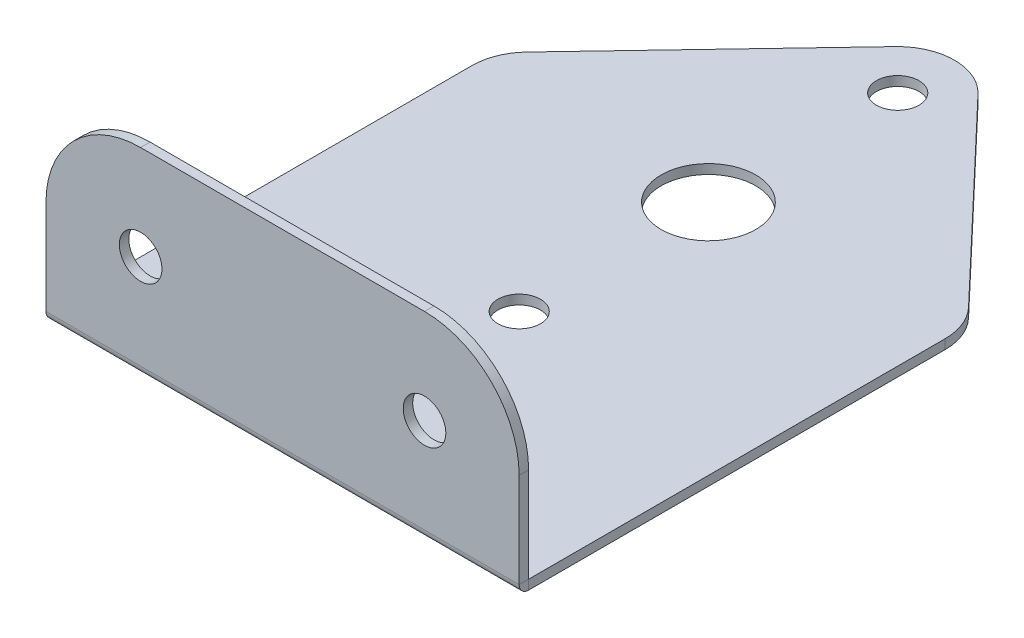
ISO-10303-21;
HEADER;
FILE_DESCRIPTION(('STEP AP214'),'2;1');
FILE_NAME('part.step','',(''),(''),'','','');
FILE_SCHEMA(('AUTOMOTIVE_DESIGN { 1 0 10303 214 1 1 1 1 }'));
ENDSEC;
DATA;
#1=APPLICATION_CONTEXT('core data for automotive mechanical design processes');
#2=APPLICATION_PROTOCOL_DEFINITION('international standard','automotive_design',2000,#1);
#3=PRODUCT_CONTEXT('',#1,'mechanical');
#4=PRODUCT('Part','Part','',(#3));
#5=PRODUCT_RELATED_PRODUCT_CATEGORY('part','',(#4));
#6=PRODUCT_DEFINITION_FORMATION('','',#4);
#7=PRODUCT_DEFINITION_CONTEXT('part definition',#1,'design');
#8=PRODUCT_DEFINITION('design','',#6,#7);
#9=PRODUCT_DEFINITION_SHAPE('','',#8);
#10=(LENGTH_UNIT() NAMED_UNIT(*) SI_UNIT(.MILLI.,.METRE.));
#11=(NAMED_UNIT(*) PLANE_ANGLE_UNIT() SI_UNIT($,.RADIAN.));
#12=(NAMED_UNIT(*) SI_UNIT($,.STERADIAN.) SOLID_ANGLE_UNIT());
#13=UNCERTAINTY_MEASURE_WITH_UNIT(LENGTH_MEASURE(1.E-05),#10,'distance_accuracy_value','');
#14=(GEOMETRIC_REPRESENTATION_CONTEXT(3) GLOBAL_UNCERTAINTY_ASSIGNED_CONTEXT((#13)) GLOBAL_UNIT_ASSIGNED_CONTEXT((#10,
#11,#12)) REPRESENTATION_CONTEXT('',''));
#15=CARTESIAN_POINT('',(0.,0.,0.));
#16=DIRECTION('',(0.,0.,1.));
#17=DIRECTION('',(1.,0.,0.));
#18=AXIS2_PLACEMENT_3D('',#15,#16,#17);
#19=CARTESIAN_POINT('',(6.,-44.995,-21.9949999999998));
#20=DIRECTION('',(0.,0.,-1.));
#21=DIRECTION('',(0.,1.,0.));
#22=AXIS2_PLACEMENT_3D('',#19,#20,#21);
#23=PLANE('',#22);
#24=CARTESIAN_POINT('',(10.,11.005,-21.995));
#25=DIRECTION('',(0.,0.,-1.));
#26=DIRECTION('',(0.,1.,0.));
#27=AXIS2_PLACEMENT_3D('',#24,#25,#26);
#28=CIRCLE('',#27,2.25);
#29=CARTESIAN_POINT('',(10.,13.255,-21.995));
#30=VERTEX_POINT('',#29);
#31=EDGE_CURVE('E240',#30,#30,#28,.T.);
#32=ORIENTED_EDGE('',*,*,#31,.F.);
#33=EDGE_LOOP('',(#32));
#34=FACE_BOUND('',#33,.T.);
#35=CARTESIAN_POINT('',(40.,11.005,-21.995));
#36=DIRECTION('',(0.,0.,-1.));
#37=DIRECTION('',(0.,1.,0.));
#38=AXIS2_PLACEMENT_3D('',#35,#36,#37);
#39=CIRCLE('',#38,2.25);
#40=CARTESIAN_POINT('',(40.,13.255,-21.995));
#41=VERTEX_POINT('',#40);
#42=EDGE_CURVE('E234',#41,#41,#39,.T.);
#43=ORIENTED_EDGE('',*,*,#42,.F.);
#44=EDGE_LOOP('',(#43));
#45=FACE_BOUND('',#44,.T.);
#46=DIRECTION('',(0.,1.,0.));
#47=VECTOR('',#46,1.);
#48=CARTESIAN_POINT('',(0.,21.005,-21.9950000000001));
#49=LINE('',#48,#47);
#50=CARTESIAN_POINT('',(0.,1.,-21.995));
#51=VERTEX_POINT('',#50);
#52=CARTESIAN_POINT('',(0.,11.005,-21.995));
#53=VERTEX_POINT('',#52);
#54=EDGE_CURVE('E250',#51,#53,#49,.T.);
#55=ORIENTED_EDGE('',*,*,#54,.T.);
#56=CARTESIAN_POINT('',(10.,11.005,-21.995));
#57=DIRECTION('',(0.,0.,-1.));
#58=DIRECTION('',(0.,1.,0.));
#59=AXIS2_PLACEMENT_3D('',#56,#57,#58);
#60=CIRCLE('',#59,10.);
#61=CARTESIAN_POINT('',(10.,21.005,-21.9950000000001));
#62=VERTEX_POINT('',#61);
#63=EDGE_CURVE('E12',#53,#62,#60,.T.);
#64=ORIENTED_EDGE('',*,*,#63,.T.);
#65=DIRECTION('',(1.,0.,0.));
#66=VECTOR('',#65,1.);
#67=CARTESIAN_POINT('',(0.,21.005,-21.9950000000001));
#68=LINE('',#67,#66);
#69=CARTESIAN_POINT('',(40.,21.005,-21.9950000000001));
#70=VERTEX_POINT('',#69);
#71=EDGE_CURVE('E247',#62,#70,#68,.T.);
#72=ORIENTED_EDGE('',*,*,#71,.T.);
#73=CARTESIAN_POINT('',(40.,11.005,-21.995));
#74=DIRECTION('',(0.,0.,-1.));
#75=DIRECTION('',(0.,1.,0.));
#76=AXIS2_PLACEMENT_3D('',#73,#74,#75);
#77=CIRCLE('',#76,10.);
#78=CARTESIAN_POINT('',(50.,11.005,-21.995));
#79=VERTEX_POINT('',#78);
#80=EDGE_CURVE('E269',#70,#79,#77,.T.);
#81=ORIENTED_EDGE('',*,*,#80,.T.);
#82=DIRECTION('',(0.,-1.,0.));
#83=VECTOR('',#82,1.);
#84=CARTESIAN_POINT('',(50.,21.005,-21.9950000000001));
#85=LINE('',#84,#83);
#86=CARTESIAN_POINT('',(50.,1.,-21.995));
#87=VERTEX_POINT('',#86);
#88=EDGE_CURVE('E249',#79,#87,#85,.T.);
#89=ORIENTED_EDGE('',*,*,#88,.T.);
#90=DIRECTION('',(-1.,0.,0.));
#91=VECTOR('',#90,1.);
#92=CARTESIAN_POINT('',(6.,1.,-21.995));
#93=LINE('',#92,#91);
#94=EDGE_CURVE('E140',#87,#51,#93,.T.);
#95=ORIENTED_EDGE('',*,*,#94,.T.);
#96=EDGE_LOOP('',(#55,#64,#72,#81,#89,#95));
#97=FACE_BOUND('',#96,.T.);
#98=ADVANCED_FACE('F36',(#34,#45,#97),#23,.T.);
#99=CARTESIAN_POINT('',(6.,-44.995,-20.9949999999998));
#100=DIRECTION('',(0.,0.,-1.));
#101=DIRECTION('',(0.,1.,0.));
#102=AXIS2_PLACEMENT_3D('',#99,#100,#101);
#103=PLANE('',#102);
#104=DIRECTION('',(1.,0.,0.));
#105=VECTOR('',#104,1.);
#106=CARTESIAN_POINT('',(0.,21.005,-20.9950000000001));
#107=LINE('',#106,#105);
#108=CARTESIAN_POINT('',(10.,21.005,-20.9950000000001));
#109=VERTEX_POINT('',#108);
#110=CARTESIAN_POINT('',(40.,21.005,-20.9950000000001));
#111=VERTEX_POINT('',#110);
#112=EDGE_CURVE('E244',#109,#111,#107,.T.);
#113=ORIENTED_EDGE('',*,*,#112,.F.);
#114=CARTESIAN_POINT('',(10.,11.005,-20.995));
#115=DIRECTION('',(0.,0.,-1.));
#116=DIRECTION('',(0.,1.,0.));
#117=AXIS2_PLACEMENT_3D('',#114,#115,#116);
#118=CIRCLE('',#117,10.);
#119=CARTESIAN_POINT('',(0.,11.005,-20.995));
#120=VERTEX_POINT('',#119);
#121=EDGE_CURVE('E58',#109,#120,#118,.F.);
#122=ORIENTED_EDGE('',*,*,#121,.T.);
#123=DIRECTION('',(0.,1.,0.));
#124=VECTOR('',#123,1.);
#125=CARTESIAN_POINT('',(0.,21.005,-20.9950000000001));
#126=LINE('',#125,#124);
#127=CARTESIAN_POINT('',(0.,1.,-20.995));
#128=VERTEX_POINT('',#127);
#129=EDGE_CURVE('E243',#128,#120,#126,.T.);
#130=ORIENTED_EDGE('',*,*,#129,.F.);
#131=DIRECTION('',(-1.,0.,0.));
#132=VECTOR('',#131,1.);
#133=CARTESIAN_POINT('',(6.,1.00000000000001,-20.995));
#134=LINE('',#133,#132);
#135=CARTESIAN_POINT('',(50.,1.,-20.995));
#136=VERTEX_POINT('',#135);
#137=EDGE_CURVE('E137',#136,#128,#134,.T.);
#138=ORIENTED_EDGE('',*,*,#137,.F.);
#139=DIRECTION('',(0.,-1.,0.));
#140=VECTOR('',#139,1.);
#141=CARTESIAN_POINT('',(50.,21.005,-20.9950000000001));
#142=LINE('',#141,#140);
#143=CARTESIAN_POINT('',(50.,11.005,-20.995));
#144=VERTEX_POINT('',#143);
#145=EDGE_CURVE('E246',#144,#136,#142,.T.);
#146=ORIENTED_EDGE('',*,*,#145,.F.);
#147=CARTESIAN_POINT('',(40.,11.005,-20.995));
#148=DIRECTION('',(0.,0.,-1.));
#149=DIRECTION('',(0.,1.,0.));
#150=AXIS2_PLACEMENT_3D('',#147,#148,#149);
#151=CIRCLE('',#150,10.);
#152=EDGE_CURVE('E263',#144,#111,#151,.F.);
#153=ORIENTED_EDGE('',*,*,#152,.T.);
#154=EDGE_LOOP('',(#113,#122,#130,#138,#146,#153));
#155=FACE_BOUND('',#154,.T.);
#156=CARTESIAN_POINT('',(10.,11.005,-20.995));
#157=DIRECTION('',(0.,0.,-1.));
#158=DIRECTION('',(0.,1.,0.));
#159=AXIS2_PLACEMENT_3D('',#156,#157,#158);
#160=CIRCLE('',#159,2.25);
#161=CARTESIAN_POINT('',(10.,13.255,-20.995));
#162=VERTEX_POINT('',#161);
#163=EDGE_CURVE('E237',#162,#162,#160,.T.);
#164=ORIENTED_EDGE('',*,*,#163,.T.);
#165=EDGE_LOOP('',(#164));
#166=FACE_BOUND('',#165,.T.);
#167=CARTESIAN_POINT('',(40.,11.005,-20.995));
#168=DIRECTION('',(0.,0.,-1.));
#169=DIRECTION('',(0.,1.,0.));
#170=AXIS2_PLACEMENT_3D('',#167,#168,#169);
#171=CIRCLE('',#170,2.25);
#172=CARTESIAN_POINT('',(40.,13.255,-20.995));
#173=VERTEX_POINT('',#172);
#174=EDGE_CURVE('E231',#173,#173,#171,.T.);
#175=ORIENTED_EDGE('',*,*,#174,.T.);
#176=EDGE_LOOP('',(#175));
#177=FACE_BOUND('',#176,.T.);
#178=ADVANCED_FACE('F280',(#155,#166,#177),#103,.F.);
#179=CARTESIAN_POINT('',(0.,21.005,-21.9950000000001));
#180=DIRECTION('',(1.,0.,0.));
#181=DIRECTION('',(0.,-1.,0.));
#182=AXIS2_PLACEMENT_3D('',#179,#180,#181);
#183=PLANE('',#182);
#184=ORIENTED_EDGE('',*,*,#129,.T.);
#185=DIRECTION('',(0.,0.,1.));
#186=VECTOR('',#185,1.);
#187=CARTESIAN_POINT('',(0.,11.005,-21.995));
#188=LINE('',#187,#186);
#189=EDGE_CURVE('E44',#120,#53,#188,.F.);
#190=ORIENTED_EDGE('',*,*,#189,.T.);
#191=ORIENTED_EDGE('',*,*,#54,.F.);
#192=DIRECTION('',(0.,0.,-1.));
#193=VECTOR('',#192,1.);
#194=CARTESIAN_POINT('',(0.,1.,-21.995));
#195=LINE('',#194,#193);
#196=EDGE_CURVE('E148',#128,#51,#195,.T.);
#197=ORIENTED_EDGE('',*,*,#196,.F.);
#198=EDGE_LOOP('',(#184,#190,#191,#197));
#199=FACE_BOUND('',#198,.T.);
#200=ADVANCED_FACE('F38',(#199),#183,.F.);
#201=CARTESIAN_POINT('',(0.,21.005,-21.9950000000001));
#202=DIRECTION('',(0.,-1.,0.));
#203=DIRECTION('',(-1.,0.,0.));
#204=AXIS2_PLACEMENT_3D('',#201,#202,#203);
#205=PLANE('',#204);
#206=ORIENTED_EDGE('',*,*,#71,.F.);
#207=DIRECTION('',(0.,0.,1.));
#208=VECTOR('',#207,1.);
#209=CARTESIAN_POINT('',(10.,21.005,-21.9950000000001));
#210=LINE('',#209,#208);
#211=EDGE_CURVE('E271',#62,#109,#210,.T.);
#212=ORIENTED_EDGE('',*,*,#211,.T.);
#213=ORIENTED_EDGE('',*,*,#112,.T.);
#214=DIRECTION('',(0.,0.,1.));
#215=VECTOR('',#214,1.);
#216=CARTESIAN_POINT('',(40.,21.005,-21.9950000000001));
#217=LINE('',#216,#215);
#218=EDGE_CURVE('E266',#111,#70,#217,.F.);
#219=ORIENTED_EDGE('',*,*,#218,.T.);
#220=EDGE_LOOP('',(#206,#212,#213,#219));
#221=FACE_BOUND('',#220,.T.);
#222=ADVANCED_FACE('F277',(#221),#205,.F.);
#223=CARTESIAN_POINT('',(50.,21.005,-21.9950000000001));
#224=DIRECTION('',(-1.,0.,0.));
#225=DIRECTION('',(0.,1.,0.));
#226=AXIS2_PLACEMENT_3D('',#223,#224,#225);
#227=PLANE('',#226);
#228=ORIENTED_EDGE('',*,*,#88,.F.);
#229=DIRECTION('',(0.,0.,1.));
#230=VECTOR('',#229,1.);
#231=CARTESIAN_POINT('',(50.,11.005,-21.995));
#232=LINE('',#231,#230);
#233=EDGE_CURVE('E256',#79,#144,#232,.T.);
#234=ORIENTED_EDGE('',*,*,#233,.T.);
#235=ORIENTED_EDGE('',*,*,#145,.T.);
#236=DIRECTION('',(0.,0.,1.));
#237=VECTOR('',#236,1.);
#238=CARTESIAN_POINT('',(50.,1.,-21.995));
#239=LINE('',#238,#237);
#240=EDGE_CURVE('E251',#87,#136,#239,.T.);
#241=ORIENTED_EDGE('',*,*,#240,.F.);
#242=EDGE_LOOP('',(#228,#234,#235,#241));
#243=FACE_BOUND('',#242,.T.);
#244=ADVANCED_FACE('F292',(#243),#227,.F.);
#245=CARTESIAN_POINT('',(10.,11.005,-21.995));
#246=DIRECTION('',(0.,0.,1.));
#247=DIRECTION('',(0.,-1.,0.));
#248=AXIS2_PLACEMENT_3D('',#245,#246,#247);
#249=CYLINDRICAL_SURFACE('',#248,2.25);
#250=ORIENTED_EDGE('',*,*,#31,.T.);
#251=EDGE_LOOP('',(#250));
#252=FACE_BOUND('',#251,.T.);
#253=ORIENTED_EDGE('',*,*,#163,.F.);
#254=EDGE_LOOP('',(#253));
#255=FACE_BOUND('',#254,.T.);
#256=ADVANCED_FACE('F351',(#252,#255),#249,.F.);
#257=CARTESIAN_POINT('',(40.,11.005,-21.995));
#258=DIRECTION('',(0.,0.,1.));
#259=DIRECTION('',(0.,-1.,0.));
#260=AXIS2_PLACEMENT_3D('',#257,#258,#259);
#261=CYLINDRICAL_SURFACE('',#260,2.25);
#262=ORIENTED_EDGE('',*,*,#42,.T.);
#263=EDGE_LOOP('',(#262));
#264=FACE_BOUND('',#263,.T.);
#265=ORIENTED_EDGE('',*,*,#174,.F.);
#266=EDGE_LOOP('',(#265));
#267=FACE_BOUND('',#266,.T.);
#268=ADVANCED_FACE('F356',(#264,#267),#261,.F.);
#269=CARTESIAN_POINT('',(25.,1.,-46.));
#270=DIRECTION('',(0.,-1.,0.));
#271=DIRECTION('',(0.,0.,-1.));
#272=AXIS2_PLACEMENT_3D('',#269,#270,#271);
#273=CYLINDRICAL_SURFACE('',#272,2.25);
#274=CARTESIAN_POINT('',(25.,1.,-46.));
#275=DIRECTION('',(0.,1.,0.));
#276=DIRECTION('',(0.,0.,1.));
#277=AXIS2_PLACEMENT_3D('',#274,#275,#276);
#278=CIRCLE('',#277,2.25);
#279=CARTESIAN_POINT('',(25.,1.,-43.75));
#280=VERTEX_POINT('',#279);
#281=EDGE_CURVE('E226',#280,#280,#278,.T.);
#282=ORIENTED_EDGE('',*,*,#281,.T.);
#283=EDGE_LOOP('',(#282));
#284=FACE_BOUND('',#283,.T.);
#285=CARTESIAN_POINT('',(25.,0.,-46.));
#286=DIRECTION('',(0.,1.,0.));
#287=DIRECTION('',(0.,0.,1.));
#288=AXIS2_PLACEMENT_3D('',#285,#286,#287);
#289=CIRCLE('',#288,2.25);
#290=CARTESIAN_POINT('',(25.,0.,-43.75));
#291=VERTEX_POINT('',#290);
#292=EDGE_CURVE('E175',#291,#291,#289,.T.);
#293=ORIENTED_EDGE('',*,*,#292,.F.);
#294=EDGE_LOOP('',(#293));
#295=FACE_BOUND('',#294,.T.);
#296=ADVANCED_FACE('F377',(#284,#295),#273,.F.);
#297=CARTESIAN_POINT('',(25.,1.,-86.));
#298=DIRECTION('',(0.,-1.,0.));
#299=DIRECTION('',(0.,0.,-1.));
#300=AXIS2_PLACEMENT_3D('',#297,#298,#299);
#301=CYLINDRICAL_SURFACE('',#300,2.25);
#302=CARTESIAN_POINT('',(25.,1.,-86.));
#303=DIRECTION('',(0.,1.,0.));
#304=DIRECTION('',(0.,0.,1.));
#305=AXIS2_PLACEMENT_3D('',#302,#303,#304);
#306=CIRCLE('',#305,2.25);
#307=CARTESIAN_POINT('',(25.,1.,-83.75));
#308=VERTEX_POINT('',#307);
#309=EDGE_CURVE('E223',#308,#308,#306,.T.);
#310=ORIENTED_EDGE('',*,*,#309,.T.);
#311=EDGE_LOOP('',(#310));
#312=FACE_BOUND('',#311,.T.);
#313=CARTESIAN_POINT('',(25.,0.,-86.));
#314=DIRECTION('',(0.,1.,0.));
#315=DIRECTION('',(0.,0.,1.));
#316=AXIS2_PLACEMENT_3D('',#313,#314,#315);
#317=CIRCLE('',#316,2.25);
#318=CARTESIAN_POINT('',(25.,0.,-83.75));
#319=VERTEX_POINT('',#318);
#320=EDGE_CURVE('E170',#319,#319,#317,.T.);
#321=ORIENTED_EDGE('',*,*,#320,.F.);
#322=EDGE_LOOP('',(#321));
#323=FACE_BOUND('',#322,.T.);
#324=ADVANCED_FACE('F336',(#312,#323),#301,.F.);
#325=CARTESIAN_POINT('',(25.,1.,-66.));
#326=DIRECTION('',(0.,-1.,0.));
#327=DIRECTION('',(0.,0.,-1.));
#328=AXIS2_PLACEMENT_3D('',#325,#326,#327);
#329=CYLINDRICAL_SURFACE('',#328,5.);
#330=CARTESIAN_POINT('',(25.,1.,-66.));
#331=DIRECTION('',(0.,1.,0.));
#332=DIRECTION('',(0.,0.,1.));
#333=AXIS2_PLACEMENT_3D('',#330,#331,#332);
#334=CIRCLE('',#333,5.);
#335=CARTESIAN_POINT('',(25.,1.,-61.));
#336=VERTEX_POINT('',#335);
#337=EDGE_CURVE('E220',#336,#336,#334,.T.);
#338=ORIENTED_EDGE('',*,*,#337,.T.);
#339=EDGE_LOOP('',(#338));
#340=FACE_BOUND('',#339,.T.);
#341=CARTESIAN_POINT('',(25.,0.,-66.));
#342=DIRECTION('',(0.,1.,0.));
#343=DIRECTION('',(0.,0.,1.));
#344=AXIS2_PLACEMENT_3D('',#341,#342,#343);
#345=CIRCLE('',#344,5.);
#346=CARTESIAN_POINT('',(25.,0.,-61.));
#347=VERTEX_POINT('',#346);
#348=EDGE_CURVE('E167',#347,#347,#345,.T.);
#349=ORIENTED_EDGE('',*,*,#348,.F.);
#350=EDGE_LOOP('',(#349));
#351=FACE_BOUND('',#350,.T.);
#352=ADVANCED_FACE('F329',(#340,#351),#329,.F.);
#353=CARTESIAN_POINT('',(6.,1.,-66.));
#354=DIRECTION('',(0.,-1.,0.));
#355=DIRECTION('',(0.,0.,-1.));
#356=AXIS2_PLACEMENT_3D('',#353,#354,#355);
#357=CYLINDRICAL_SURFACE('',#356,5.99999999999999);
#358=CARTESIAN_POINT('',(6.,0.,-66.));
#359=DIRECTION('',(0.,1.,0.));
#360=DIRECTION('',(0.,0.,1.));
#361=AXIS2_PLACEMENT_3D('',#358,#359,#360);
#362=CIRCLE('',#361,5.99999999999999);
#363=CARTESIAN_POINT('',(1.65000339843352,0.,-70.1324967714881));
#364=VERTEX_POINT('',#363);
#365=CARTESIAN_POINT('',(0.,0.,-66.));
#366=VERTEX_POINT('',#365);
#367=EDGE_CURVE('E218',#364,#366,#362,.T.);
#368=ORIENTED_EDGE('',*,*,#367,.T.);
#369=DIRECTION('',(0.,-1.,0.));
#370=VECTOR('',#369,1.);
#371=CARTESIAN_POINT('',(0.,1.,-66.));
#372=LINE('',#371,#370);
#373=CARTESIAN_POINT('',(0.,1.,-66.));
#374=VERTEX_POINT('',#373);
#375=EDGE_CURVE('E152',#374,#366,#372,.T.);
#376=ORIENTED_EDGE('',*,*,#375,.F.);
#377=CARTESIAN_POINT('',(6.,1.,-66.));
#378=DIRECTION('',(0.,1.,0.));
#379=DIRECTION('',(0.,0.,1.));
#380=AXIS2_PLACEMENT_3D('',#377,#378,#379);
#381=CIRCLE('',#380,5.99999999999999);
#382=CARTESIAN_POINT('',(1.65000339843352,1.,-70.1324967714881));
#383=VERTEX_POINT('',#382);
#384=EDGE_CURVE('E183',#383,#374,#381,.T.);
#385=ORIENTED_EDGE('',*,*,#384,.F.);
#386=DIRECTION('',(0.,-1.,0.));
#387=VECTOR('',#386,1.);
#388=CARTESIAN_POINT('',(1.65000339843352,1.,-70.1324967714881));
#389=LINE('',#388,#387);
#390=EDGE_CURVE('E215',#383,#364,#389,.T.);
#391=ORIENTED_EDGE('',*,*,#390,.T.);
#392=EDGE_LOOP('',(#368,#376,#385,#391));
#393=FACE_BOUND('',#392,.T.);
#394=ADVANCED_FACE('F325',(#393),#357,.T.);
#395=CARTESIAN_POINT('',(1.65000339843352,1.,-70.1324967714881));
#396=DIRECTION('',(0.724999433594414,0.,0.688749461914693));
#397=DIRECTION('',(0.688749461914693,0.,-0.724999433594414));
#398=AXIS2_PLACEMENT_3D('',#395,#396,#397);
#399=PLANE('',#398);
#400=DIRECTION('',(-0.688749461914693,0.,0.724999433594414));
#401=VECTOR('',#400,1.);
#402=CARTESIAN_POINT('',(1.65000339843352,0.,-70.1324967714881));
#403=LINE('',#402,#401);
#404=CARTESIAN_POINT('',(20.6500033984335,0.,-90.1324967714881));
#405=VERTEX_POINT('',#404);
#406=EDGE_CURVE('E213',#405,#364,#403,.T.);
#407=ORIENTED_EDGE('',*,*,#406,.T.);
#408=ORIENTED_EDGE('',*,*,#390,.F.);
#409=DIRECTION('',(-0.688749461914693,0.,0.724999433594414));
#410=VECTOR('',#409,1.);
#411=CARTESIAN_POINT('',(1.65000339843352,1.,-70.1324967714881));
#412=LINE('',#411,#410);
#413=CARTESIAN_POINT('',(20.6500033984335,1.,-90.1324967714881));
#414=VERTEX_POINT('',#413);
#415=EDGE_CURVE('E185',#414,#383,#412,.T.);
#416=ORIENTED_EDGE('',*,*,#415,.F.);
#417=DIRECTION('',(0.,-1.,0.));
#418=VECTOR('',#417,1.);
#419=CARTESIAN_POINT('',(20.6500033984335,1.,-90.1324967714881));
#420=LINE('',#419,#418);
#421=EDGE_CURVE('E210',#414,#405,#420,.T.);
#422=ORIENTED_EDGE('',*,*,#421,.T.);
#423=EDGE_LOOP('',(#407,#408,#416,#422));
#424=FACE_BOUND('',#423,.T.);
#425=ADVANCED_FACE('F322',(#424),#399,.F.);
#426=CARTESIAN_POINT('',(25.,1.,-86.));
#427=DIRECTION('',(0.,-1.,0.));
#428=DIRECTION('',(0.,0.,-1.));
#429=AXIS2_PLACEMENT_3D('',#426,#427,#428);
#430=CYLINDRICAL_SURFACE('',#429,5.99999999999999);
#431=CARTESIAN_POINT('',(25.,0.,-86.));
#432=DIRECTION('',(0.,1.,0.));
#433=DIRECTION('',(0.,0.,1.));
#434=AXIS2_PLACEMENT_3D('',#431,#432,#433);
#435=CIRCLE('',#434,5.99999999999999);
#436=CARTESIAN_POINT('',(29.3499966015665,0.,-90.1324967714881));
#437=VERTEX_POINT('',#436);
#438=EDGE_CURVE('E208',#437,#405,#435,.T.);
#439=ORIENTED_EDGE('',*,*,#438,.T.);
#440=ORIENTED_EDGE('',*,*,#421,.F.);
#441=CARTESIAN_POINT('',(25.,1.,-86.));
#442=DIRECTION('',(0.,1.,0.));
#443=DIRECTION('',(0.,0.,1.));
#444=AXIS2_PLACEMENT_3D('',#441,#442,#443);
#445=CIRCLE('',#444,5.99999999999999);
#446=CARTESIAN_POINT('',(29.3499966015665,1.,-90.1324967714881));
#447=VERTEX_POINT('',#446);
#448=EDGE_CURVE('E187',#447,#414,#445,.T.);
#449=ORIENTED_EDGE('',*,*,#448,.F.);
#450=DIRECTION('',(0.,-1.,0.));
#451=VECTOR('',#450,1.);
#452=CARTESIAN_POINT('',(29.3499966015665,1.,-90.1324967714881));
#453=LINE('',#452,#451);
#454=EDGE_CURVE('E205',#447,#437,#453,.T.);
#455=ORIENTED_EDGE('',*,*,#454,.T.);
#456=EDGE_LOOP('',(#439,#440,#449,#455));
#457=FACE_BOUND('',#456,.T.);
#458=ADVANCED_FACE('F317',(#457),#430,.T.);
#459=CARTESIAN_POINT('',(48.3499966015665,1.,-70.1324967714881));
#460=DIRECTION('',(-0.724999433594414,0.,0.688749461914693));
#461=DIRECTION('',(0.688749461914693,0.,0.724999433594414));
#462=AXIS2_PLACEMENT_3D('',#459,#460,#461);
#463=PLANE('',#462);
#464=DIRECTION('',(-0.688749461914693,0.,-0.724999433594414));
#465=VECTOR('',#464,1.);
#466=CARTESIAN_POINT('',(48.3499966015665,0.,-70.1324967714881));
#467=LINE('',#466,#465);
#468=CARTESIAN_POINT('',(48.3499966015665,0.,-70.1324967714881));
#469=VERTEX_POINT('',#468);
#470=EDGE_CURVE('E203',#469,#437,#467,.T.);
#471=ORIENTED_EDGE('',*,*,#470,.T.);
#472=ORIENTED_EDGE('',*,*,#454,.F.);
#473=DIRECTION('',(-0.688749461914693,0.,-0.724999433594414));
#474=VECTOR('',#473,1.);
#475=CARTESIAN_POINT('',(48.3499966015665,1.,-70.1324967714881));
#476=LINE('',#475,#474);
#477=CARTESIAN_POINT('',(48.3499966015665,1.,-70.1324967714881));
#478=VERTEX_POINT('',#477);
#479=EDGE_CURVE('E189',#478,#447,#476,.T.);
#480=ORIENTED_EDGE('',*,*,#479,.F.);
#481=DIRECTION('',(0.,-1.,0.));
#482=VECTOR('',#481,1.);
#483=CARTESIAN_POINT('',(48.3499966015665,1.,-70.1324967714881));
#484=LINE('',#483,#482);
#485=EDGE_CURVE('E200',#478,#469,#484,.T.);
#486=ORIENTED_EDGE('',*,*,#485,.T.);
#487=EDGE_LOOP('',(#471,#472,#480,#486));
#488=FACE_BOUND('',#487,.T.);
#489=ADVANCED_FACE('F313',(#488),#463,.F.);
#490=CARTESIAN_POINT('',(44.,1.,-66.));
#491=DIRECTION('',(0.,-1.,0.));
#492=DIRECTION('',(0.,0.,-1.));
#493=AXIS2_PLACEMENT_3D('',#490,#491,#492);
#494=CYLINDRICAL_SURFACE('',#493,5.99999999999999);
#495=CARTESIAN_POINT('',(44.,0.,-66.));
#496=DIRECTION('',(0.,1.,0.));
#497=DIRECTION('',(0.,0.,1.));
#498=AXIS2_PLACEMENT_3D('',#495,#496,#497);
#499=CIRCLE('',#498,5.99999999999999);
#500=CARTESIAN_POINT('',(50.,0.,-66.));
#501=VERTEX_POINT('',#500);
#502=EDGE_CURVE('E198',#501,#469,#499,.T.);
#503=ORIENTED_EDGE('',*,*,#502,.T.);
#504=ORIENTED_EDGE('',*,*,#485,.F.);
#505=CARTESIAN_POINT('',(44.,1.,-66.));
#506=DIRECTION('',(0.,1.,0.));
#507=DIRECTION('',(0.,0.,1.));
#508=AXIS2_PLACEMENT_3D('',#505,#506,#507);
#509=CIRCLE('',#508,5.99999999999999);
#510=CARTESIAN_POINT('',(50.,1.,-66.));
#511=VERTEX_POINT('',#510);
#512=EDGE_CURVE('E191',#511,#478,#509,.T.);
#513=ORIENTED_EDGE('',*,*,#512,.F.);
#514=DIRECTION('',(0.,-1.,0.));
#515=VECTOR('',#514,1.);
#516=CARTESIAN_POINT('',(50.,1.,-66.));
#517=LINE('',#516,#515);
#518=EDGE_CURVE('E195',#511,#501,#517,.T.);
#519=ORIENTED_EDGE('',*,*,#518,.T.);
#520=EDGE_LOOP('',(#503,#504,#513,#519));
#521=FACE_BOUND('',#520,.T.);
#522=ADVANCED_FACE('F307',(#521),#494,.T.);
#523=CARTESIAN_POINT('',(6.,1.,-66.));
#524=DIRECTION('',(0.,1.,0.));
#525=DIRECTION('',(0.,0.,1.));
#526=AXIS2_PLACEMENT_3D('',#523,#524,#525);
#527=PLANE('',#526);
#528=ORIENTED_EDGE('',*,*,#94,.F.);
#529=DIRECTION('',(0.,0.,-1.));
#530=VECTOR('',#529,1.);
#531=CARTESIAN_POINT('',(50.,1.,0.));
#532=LINE('',#531,#530);
#533=EDGE_CURVE('E193',#87,#511,#532,.T.);
#534=ORIENTED_EDGE('',*,*,#533,.T.);
#535=ORIENTED_EDGE('',*,*,#512,.T.);
#536=ORIENTED_EDGE('',*,*,#479,.T.);
#537=ORIENTED_EDGE('',*,*,#448,.T.);
#538=ORIENTED_EDGE('',*,*,#415,.T.);
#539=ORIENTED_EDGE('',*,*,#384,.T.);
#540=DIRECTION('',(0.,0.,1.));
#541=VECTOR('',#540,1.);
#542=CARTESIAN_POINT('',(0.,1.,0.));
#543=LINE('',#542,#541);
#544=EDGE_CURVE('E181',#374,#51,#543,.T.);
#545=ORIENTED_EDGE('',*,*,#544,.T.);
#546=EDGE_LOOP('',(#528,#534,#535,#536,#537,#538,#539,#545));
#547=FACE_BOUND('',#546,.T.);
#548=ORIENTED_EDGE('',*,*,#337,.F.);
#549=EDGE_LOOP('',(#548));
#550=FACE_BOUND('',#549,.T.);
#551=ORIENTED_EDGE('',*,*,#309,.F.);
#552=EDGE_LOOP('',(#551));
#553=FACE_BOUND('',#552,.T.);
#554=ORIENTED_EDGE('',*,*,#281,.F.);
#555=EDGE_LOOP('',(#554));
#556=FACE_BOUND('',#555,.T.);
#557=ADVANCED_FACE('F300',(#547,#550,#553,#556),#527,.T.);
#558=CARTESIAN_POINT('',(50.,1.,0.));
#559=DIRECTION('',(-1.,0.,0.));
#560=DIRECTION('',(0.,0.,1.));
#561=AXIS2_PLACEMENT_3D('',#558,#559,#560);
#562=PLANE('',#561);
#563=ORIENTED_EDGE('',*,*,#533,.F.);
#564=DIRECTION('',(0.,-1.,0.));
#565=VECTOR('',#564,1.);
#566=CARTESIAN_POINT('',(50.,0.999999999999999,-21.995));
#567=LINE('',#566,#565);
#568=CARTESIAN_POINT('',(50.,0.,-21.995));
#569=VERTEX_POINT('',#568);
#570=EDGE_CURVE('E179',#87,#569,#567,.T.);
#571=ORIENTED_EDGE('',*,*,#570,.T.);
#572=DIRECTION('',(0.,0.,-1.));
#573=VECTOR('',#572,1.);
#574=CARTESIAN_POINT('',(50.,0.,0.));
#575=LINE('',#574,#573);
#576=EDGE_CURVE('E165',#569,#501,#575,.T.);
#577=ORIENTED_EDGE('',*,*,#576,.T.);
#578=ORIENTED_EDGE('',*,*,#518,.F.);
#579=EDGE_LOOP('',(#563,#571,#577,#578));
#580=FACE_BOUND('',#579,.T.);
#581=ADVANCED_FACE('F303',(#580),#562,.F.);
#582=CARTESIAN_POINT('',(6.,0.,-66.));
#583=DIRECTION('',(0.,1.,0.));
#584=DIRECTION('',(0.,0.,1.));
#585=AXIS2_PLACEMENT_3D('',#582,#583,#584);
#586=PLANE('',#585);
#587=ORIENTED_EDGE('',*,*,#292,.T.);
#588=EDGE_LOOP('',(#587));
#589=FACE_BOUND('',#588,.T.);
#590=ORIENTED_EDGE('',*,*,#320,.T.);
#591=EDGE_LOOP('',(#590));
#592=FACE_BOUND('',#591,.T.);
#593=ORIENTED_EDGE('',*,*,#348,.T.);
#594=EDGE_LOOP('',(#593));
#595=FACE_BOUND('',#594,.T.);
#596=ORIENTED_EDGE('',*,*,#576,.F.);
#597=DIRECTION('',(-1.,0.,0.));
#598=VECTOR('',#597,1.);
#599=CARTESIAN_POINT('',(6.,0.,-21.995));
#600=LINE('',#599,#598);
#601=CARTESIAN_POINT('',(0.,0.,-21.995));
#602=VERTEX_POINT('',#601);
#603=EDGE_CURVE('E134',#569,#602,#600,.T.);
#604=ORIENTED_EDGE('',*,*,#603,.T.);
#605=DIRECTION('',(0.,0.,1.));
#606=VECTOR('',#605,1.);
#607=CARTESIAN_POINT('',(0.,0.,0.));
#608=LINE('',#607,#606);
#609=EDGE_CURVE('E153',#366,#602,#608,.T.);
#610=ORIENTED_EDGE('',*,*,#609,.F.);
#611=ORIENTED_EDGE('',*,*,#367,.F.);
#612=ORIENTED_EDGE('',*,*,#406,.F.);
#613=ORIENTED_EDGE('',*,*,#438,.F.);
#614=ORIENTED_EDGE('',*,*,#470,.F.);
#615=ORIENTED_EDGE('',*,*,#502,.F.);
#616=EDGE_LOOP('',(#596,#604,#610,#611,#612,#613,#614,#615));
#617=FACE_BOUND('',#616,.T.);
#618=ADVANCED_FACE('F163',(#589,#592,#595,#617),#586,.F.);
#619=CARTESIAN_POINT('',(0.,1.,0.));
#620=DIRECTION('',(1.,0.,0.));
#621=DIRECTION('',(0.,0.,-1.));
#622=AXIS2_PLACEMENT_3D('',#619,#620,#621);
#623=PLANE('',#622);
#624=ORIENTED_EDGE('',*,*,#609,.T.);
#625=DIRECTION('',(0.,1.,0.));
#626=VECTOR('',#625,1.);
#627=CARTESIAN_POINT('',(0.,0.999999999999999,-21.995));
#628=LINE('',#627,#626);
#629=EDGE_CURVE('E144',#602,#51,#628,.T.);
#630=ORIENTED_EDGE('',*,*,#629,.T.);
#631=ORIENTED_EDGE('',*,*,#544,.F.);
#632=ORIENTED_EDGE('',*,*,#375,.T.);
#633=EDGE_LOOP('',(#624,#630,#631,#632));
#634=FACE_BOUND('',#633,.T.);
#635=ADVANCED_FACE('F157',(#634),#623,.F.);
#636=CARTESIAN_POINT('',(0.,1.,-21.995));
#637=DIRECTION('',(-1.,0.,0.));
#638=DIRECTION('',(0.,0.,1.));
#639=AXIS2_PLACEMENT_3D('',#636,#637,#638);
#640=PLANE('',#639);
#641=CARTESIAN_POINT('',(0.,1.,-21.995));
#642=DIRECTION('',(1.,0.,0.));
#643=DIRECTION('',(0.,0.,-1.));
#644=AXIS2_PLACEMENT_3D('',#641,#642,#643);
#645=CIRCLE('',#644,1.);
#646=EDGE_CURVE('E129',#128,#602,#645,.T.);
#647=ORIENTED_EDGE('',*,*,#646,.F.);
#648=ORIENTED_EDGE('',*,*,#196,.T.);
#649=ORIENTED_EDGE('',*,*,#629,.F.);
#650=EDGE_LOOP('',(#647,#648,#649));
#651=FACE_BOUND('',#650,.T.);
#652=ADVANCED_FACE('F146',(#651),#640,.T.);
#653=CARTESIAN_POINT('',(50.,1.,-21.995));
#654=DIRECTION('',(1.,0.,0.));
#655=DIRECTION('',(0.,0.,-1.));
#656=AXIS2_PLACEMENT_3D('',#653,#654,#655);
#657=CYLINDRICAL_SURFACE('',#656,1.);
#658=CARTESIAN_POINT('',(50.,1.,-21.995));
#659=DIRECTION('',(1.,0.,0.));
#660=DIRECTION('',(0.,0.,-1.));
#661=AXIS2_PLACEMENT_3D('',#658,#659,#660);
#662=CIRCLE('',#661,1.);
#663=EDGE_CURVE('E141',#136,#569,#662,.T.);
#664=ORIENTED_EDGE('',*,*,#663,.F.);
#665=ORIENTED_EDGE('',*,*,#137,.T.);
#666=ORIENTED_EDGE('',*,*,#646,.T.);
#667=ORIENTED_EDGE('',*,*,#603,.F.);
#668=EDGE_LOOP('',(#664,#665,#666,#667));
#669=FACE_BOUND('',#668,.T.);
#670=ADVANCED_FACE('F132',(#669),#657,.T.);
#671=CARTESIAN_POINT('',(50.,1.,-21.995));
#672=DIRECTION('',(1.,0.,0.));
#673=DIRECTION('',(0.,0.,-1.));
#674=AXIS2_PLACEMENT_3D('',#671,#672,#673);
#675=PLANE('',#674);
#676=ORIENTED_EDGE('',*,*,#240,.T.);
#677=ORIENTED_EDGE('',*,*,#663,.T.);
#678=ORIENTED_EDGE('',*,*,#570,.F.);
#679=EDGE_LOOP('',(#676,#677,#678));
#680=FACE_BOUND('',#679,.T.);
#681=ADVANCED_FACE('F296',(#680),#675,.T.);
#682=CARTESIAN_POINT('',(40.,11.005,-21.995));
#683=DIRECTION('',(0.,0.,1.));
#684=DIRECTION('',(0.,-1.,0.));
#685=AXIS2_PLACEMENT_3D('',#682,#683,#684);
#686=CYLINDRICAL_SURFACE('',#685,10.);
#687=ORIENTED_EDGE('',*,*,#80,.F.);
#688=ORIENTED_EDGE('',*,*,#218,.F.);
#689=ORIENTED_EDGE('',*,*,#152,.F.);
#690=ORIENTED_EDGE('',*,*,#233,.F.);
#691=EDGE_LOOP('',(#687,#688,#689,#690));
#692=FACE_BOUND('',#691,.T.);
#693=ADVANCED_FACE('F287',(#692),#686,.T.);
#694=CARTESIAN_POINT('',(10.,11.005,-21.995));
#695=DIRECTION('',(0.,0.,1.));
#696=DIRECTION('',(0.,-1.,0.));
#697=AXIS2_PLACEMENT_3D('',#694,#695,#696);
#698=CYLINDRICAL_SURFACE('',#697,10.);
#699=ORIENTED_EDGE('',*,*,#63,.F.);
#700=ORIENTED_EDGE('',*,*,#189,.F.);
#701=ORIENTED_EDGE('',*,*,#121,.F.);
#702=ORIENTED_EDGE('',*,*,#211,.F.);
#703=EDGE_LOOP('',(#699,#700,#701,#702));
#704=FACE_BOUND('',#703,.T.);
#705=ADVANCED_FACE('F363',(#704),#698,.T.);
#706=CLOSED_SHELL('',(#98,#178,#200,#222,#244,#256,#268,#296,#324,#352,#394,#425,#458,#489,#522,
#557,#581,#618,#635,#652,#670,#681,#693,#705));
#707=MANIFOLD_SOLID_BREP('B2',#706);
#708=ADVANCED_BREP_SHAPE_REPRESENTATION('',(#18,#707),#14);
#709=SHAPE_DEFINITION_REPRESENTATION(#9,#708);
ENDSEC;
END-ISO-10303-21;
